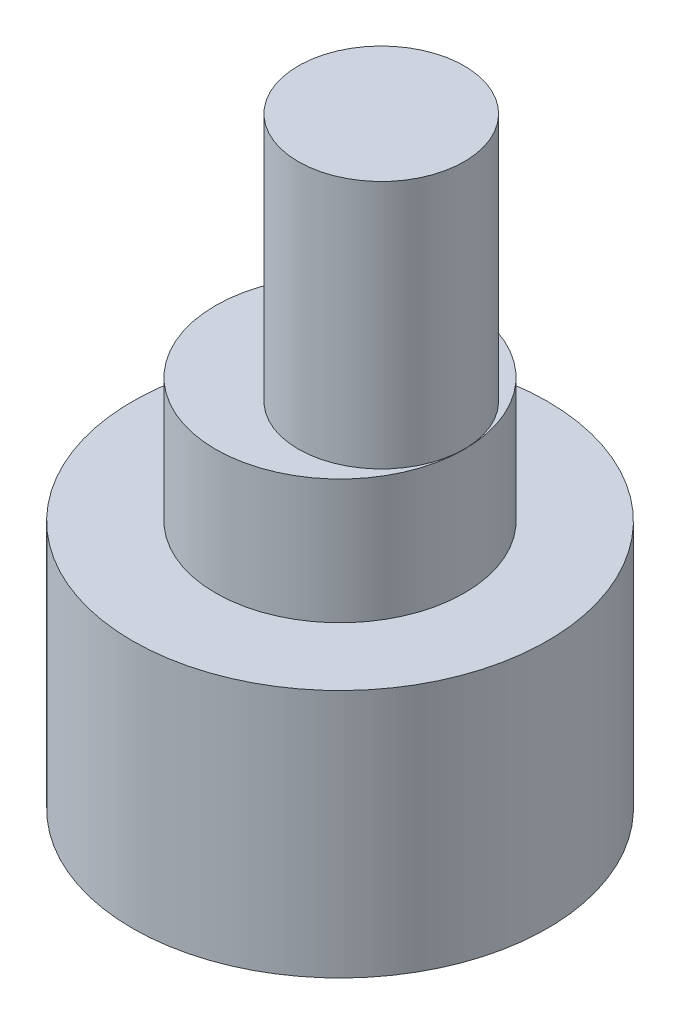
from build123d import *

# Parameters (mm, degrees)
SKETCH1_R           = 1.5
BOSS_EXTRUDE1_DEPTH = 4.5
SKETCH2_R           = 1
BOSS_EXTRUDE2_DEPTH = 3
SKETCH3_R           = 2.5
BOSS_EXTRUDE3_DEPTH = 3


with BuildPart() as part:
    # Sketch1 → Boss-Extrude1 (new body)
    with BuildSketch(Plane(origin=(0, 0, 0), x_dir=(1, 0, 0), z_dir=(0, 1, 0))):
        with Locations(Location((0, 0, 0), (0, 0, 270))):
            Circle(SKETCH1_R)
    extrude(amount=BOSS_EXTRUDE1_DEPTH)

    # Sketch2 → Boss-Extrude2 (add)
    with BuildSketch(Plane(origin=(0, 4.5, 0), x_dir=(1, 0, 0), z_dir=(0, 1, 0))):
        with Locations(Location((0.49736, 0, 0), (0, 0, 270))):
            Circle(SKETCH2_R)
    extrude(amount=BOSS_EXTRUDE2_DEPTH)

    # Sketch3 → Boss-Extrude3 (add)
    with BuildSketch(Plane.XZ):
        with Locations(Location((0, 0, 0), (0, 0, 270))):
            Circle(SKETCH3_R)
    extrude(amount=-BOSS_EXTRUDE3_DEPTH)


solid = part.part
